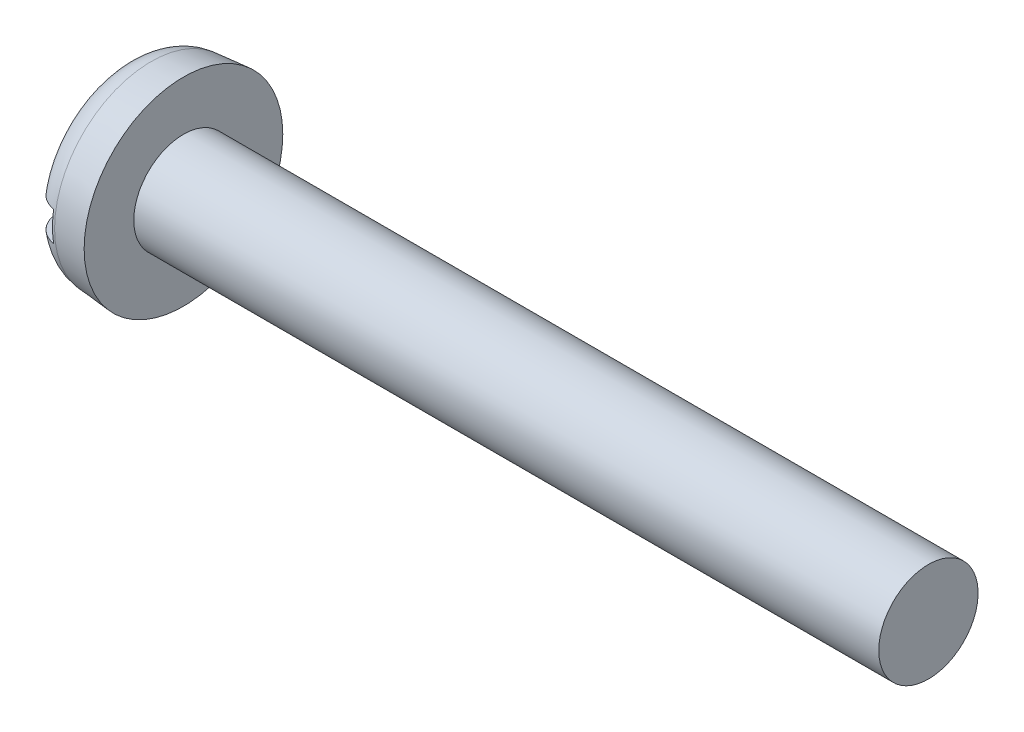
from build123d import *

# Parameters (mm, degrees)
FILLET2_R  = 1.2
SKETCH2_W  = 8
SKETCH2_H  = 1.2
SLOT_DEPTH = 1


with BuildPart() as part:
    # BodySke → Base-Revolve (revolve)
    with BuildSketch(Plane.XY, mode=Mode.PRIVATE) as base_revolve_sk:
        Polygon((2.4, 2), (2.4, 4), (0, 3.790027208), (0, 0), (32.4, 0), (32.4, 2), align=None)
    revolve(base_revolve_sk.sketch.rotate(Axis((-25.4, 0, 0), (1, 0, 0)), 90), axis=Axis((-25.4, 0, 0), (1, 0, 0)))

    # Fillet2
    fillet2_edges = [part.edges().sort_by_distance(p)[0] for p in [
        (0, 0, -3.790027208),
    ]]
    fillet(fillet2_edges, radius=FILLET2_R)

    # Sketch2 → Slot (cut)
    with BuildSketch(Plane(origin=(0, 0, 0), x_dir=(0, 0, -1), z_dir=(1, 0, 0))):
        Rectangle(SKETCH2_W, SKETCH2_H)
    extrude(amount=SLOT_DEPTH, mode=Mode.SUBTRACT)


solid = part.part
